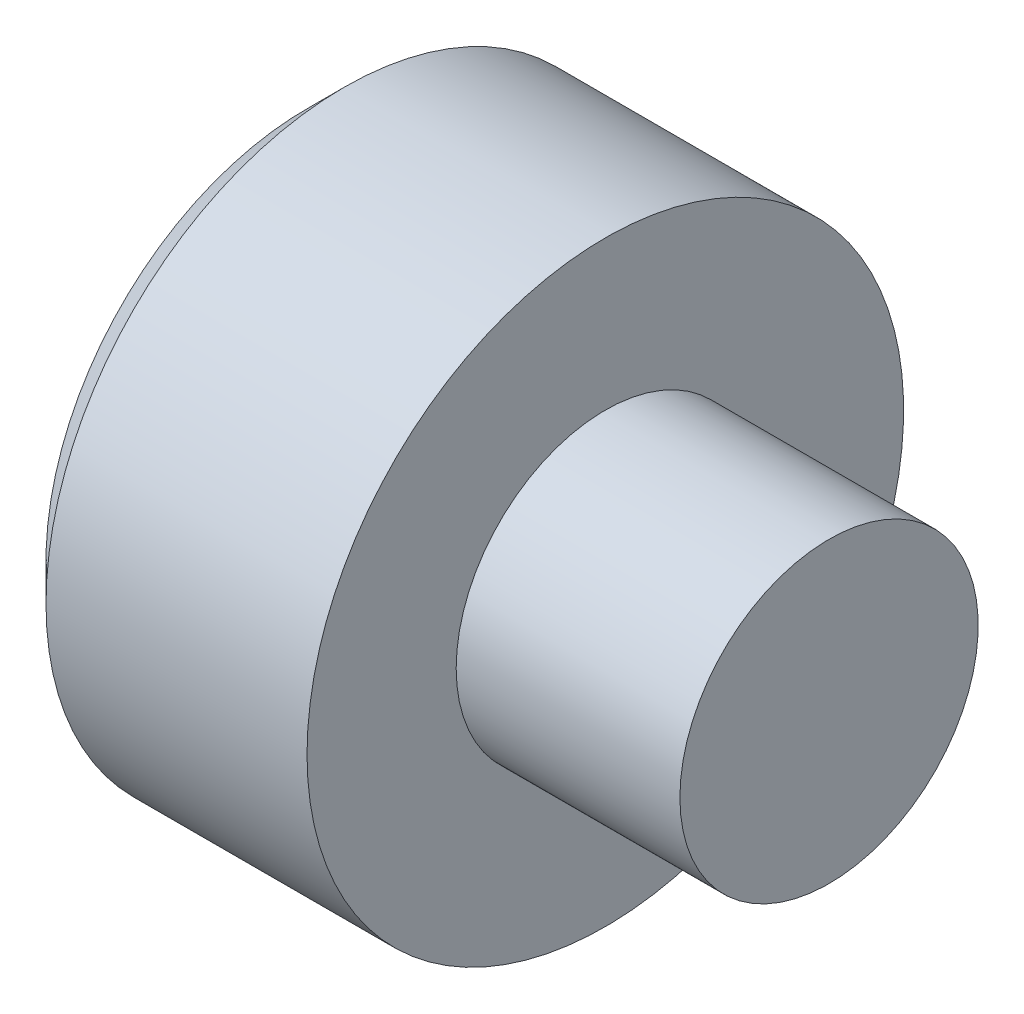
ISO-10303-21;
HEADER;
FILE_DESCRIPTION(('STEP AP214'),'2;1');
FILE_NAME('part.step','',(''),(''),'','','');
FILE_SCHEMA(('AUTOMOTIVE_DESIGN { 1 0 10303 214 1 1 1 1 }'));
ENDSEC;
DATA;
#1=APPLICATION_CONTEXT('core data for automotive mechanical design processes');
#2=APPLICATION_PROTOCOL_DEFINITION('international standard','automotive_design',2000,#1);
#3=PRODUCT_CONTEXT('',#1,'mechanical');
#4=PRODUCT('Part','Part','',(#3));
#5=PRODUCT_RELATED_PRODUCT_CATEGORY('part','',(#4));
#6=PRODUCT_DEFINITION_FORMATION('','',#4);
#7=PRODUCT_DEFINITION_CONTEXT('part definition',#1,'design');
#8=PRODUCT_DEFINITION('design','',#6,#7);
#9=PRODUCT_DEFINITION_SHAPE('','',#8);
#10=(LENGTH_UNIT() NAMED_UNIT(*) SI_UNIT(.MILLI.,.METRE.));
#11=(NAMED_UNIT(*) PLANE_ANGLE_UNIT() SI_UNIT($,.RADIAN.));
#12=(NAMED_UNIT(*) SI_UNIT($,.STERADIAN.) SOLID_ANGLE_UNIT());
#13=UNCERTAINTY_MEASURE_WITH_UNIT(LENGTH_MEASURE(1.E-05),#10,'distance_accuracy_value','');
#14=(GEOMETRIC_REPRESENTATION_CONTEXT(3) GLOBAL_UNCERTAINTY_ASSIGNED_CONTEXT((#13)) GLOBAL_UNIT_ASSIGNED_CONTEXT((#10,
#11,#12)) REPRESENTATION_CONTEXT('',''));
#15=CARTESIAN_POINT('',(0.,0.,0.));
#16=DIRECTION('',(0.,0.,1.));
#17=DIRECTION('',(1.,0.,0.));
#18=AXIS2_PLACEMENT_3D('',#15,#16,#17);
#19=CARTESIAN_POINT('',(0.,0.,0.));
#20=DIRECTION('',(1.,0.,0.));
#21=DIRECTION('',(0.,0.,-1.));
#22=AXIS2_PLACEMENT_3D('',#19,#20,#21);
#23=PLANE('',#22);
#24=CARTESIAN_POINT('',(0.,0.,0.));
#25=DIRECTION('',(1.,0.,0.));
#26=DIRECTION('',(0.,0.,-1.));
#27=AXIS2_PLACEMENT_3D('',#24,#25,#26);
#28=CIRCLE('',#27,3.5);
#29=CARTESIAN_POINT('',(0.,0.,-3.5));
#30=VERTEX_POINT('',#29);
#31=EDGE_CURVE('E37',#30,#30,#28,.F.);
#32=ORIENTED_EDGE('',*,*,#31,.T.);
#33=EDGE_LOOP('',(#32));
#34=FACE_BOUND('',#33,.T.);
#35=ADVANCED_FACE('F31',(#34),#23,.F.);
#36=CARTESIAN_POINT('',(-17.1561403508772,0.,0.));
#37=DIRECTION('',(-1.,0.,0.));
#38=DIRECTION('',(0.,0.,1.));
#39=AXIS2_PLACEMENT_3D('',#36,#37,#38);
#40=CYLINDRICAL_SURFACE('',#39,4.);
#41=CARTESIAN_POINT('',(0.5,0.,0.));
#42=DIRECTION('',(1.,0.,0.));
#43=DIRECTION('',(0.,0.,-1.));
#44=AXIS2_PLACEMENT_3D('',#41,#42,#43);
#45=CIRCLE('',#44,4.);
#46=CARTESIAN_POINT('',(0.5,0.,-4.));
#47=VERTEX_POINT('',#46);
#48=EDGE_CURVE('E10',#47,#47,#45,.T.);
#49=ORIENTED_EDGE('',*,*,#48,.T.);
#50=EDGE_LOOP('',(#49));
#51=FACE_BOUND('',#50,.T.);
#52=CARTESIAN_POINT('',(4.,0.,0.));
#53=DIRECTION('',(-1.,0.,0.));
#54=DIRECTION('',(0.,0.,1.));
#55=AXIS2_PLACEMENT_3D('',#52,#53,#54);
#56=CIRCLE('',#55,4.);
#57=CARTESIAN_POINT('',(4.,0.,4.));
#58=VERTEX_POINT('',#57);
#59=EDGE_CURVE('E41',#58,#58,#56,.T.);
#60=ORIENTED_EDGE('',*,*,#59,.T.);
#61=EDGE_LOOP('',(#60));
#62=FACE_BOUND('',#61,.T.);
#63=ADVANCED_FACE('F70',(#51,#62),#40,.T.);
#64=CARTESIAN_POINT('',(4.,4.,0.));
#65=DIRECTION('',(-1.,0.,0.));
#66=DIRECTION('',(0.,0.,1.));
#67=AXIS2_PLACEMENT_3D('',#64,#65,#66);
#68=PLANE('',#67);
#69=ORIENTED_EDGE('',*,*,#59,.F.);
#70=EDGE_LOOP('',(#69));
#71=FACE_BOUND('',#70,.T.);
#72=CARTESIAN_POINT('',(4.,0.,0.));
#73=DIRECTION('',(-1.,0.,0.));
#74=DIRECTION('',(0.,0.,1.));
#75=AXIS2_PLACEMENT_3D('',#72,#73,#74);
#76=CIRCLE('',#75,2.);
#77=CARTESIAN_POINT('',(4.,0.,2.));
#78=VERTEX_POINT('',#77);
#79=EDGE_CURVE('E45',#78,#78,#76,.T.);
#80=ORIENTED_EDGE('',*,*,#79,.T.);
#81=EDGE_LOOP('',(#80));
#82=FACE_BOUND('',#81,.T.);
#83=ADVANCED_FACE('F66',(#71,#82),#68,.F.);
#84=CARTESIAN_POINT('',(-17.1561403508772,0.,0.));
#85=DIRECTION('',(-1.,0.,0.));
#86=DIRECTION('',(0.,0.,1.));
#87=AXIS2_PLACEMENT_3D('',#84,#85,#86);
#88=CYLINDRICAL_SURFACE('',#87,2.);
#89=ORIENTED_EDGE('',*,*,#79,.F.);
#90=EDGE_LOOP('',(#89));
#91=FACE_BOUND('',#90,.T.);
#92=CARTESIAN_POINT('',(7.,0.,0.));
#93=DIRECTION('',(-1.,0.,0.));
#94=DIRECTION('',(0.,0.,1.));
#95=AXIS2_PLACEMENT_3D('',#92,#93,#94);
#96=CIRCLE('',#95,2.);
#97=CARTESIAN_POINT('',(7.,0.,2.));
#98=VERTEX_POINT('',#97);
#99=EDGE_CURVE('E50',#98,#98,#96,.T.);
#100=ORIENTED_EDGE('',*,*,#99,.T.);
#101=EDGE_LOOP('',(#100));
#102=FACE_BOUND('',#101,.T.);
#103=ADVANCED_FACE('F54',(#91,#102),#88,.T.);
#104=CARTESIAN_POINT('',(7.,2.,0.));
#105=DIRECTION('',(-1.,0.,0.));
#106=DIRECTION('',(0.,0.,1.));
#107=AXIS2_PLACEMENT_3D('',#104,#105,#106);
#108=PLANE('',#107);
#109=ORIENTED_EDGE('',*,*,#99,.F.);
#110=EDGE_LOOP('',(#109));
#111=FACE_BOUND('',#110,.T.);
#112=ADVANCED_FACE('F56',(#111),#108,.F.);
#113=CARTESIAN_POINT('',(0.,0.,0.));
#114=DIRECTION('',(1.,0.,0.));
#115=DIRECTION('',(0.,0.,-1.));
#116=AXIS2_PLACEMENT_3D('',#113,#114,#115);
#117=CONICAL_SURFACE('',#116,3.5,0.785398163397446);
#118=ORIENTED_EDGE('',*,*,#48,.F.);
#119=EDGE_LOOP('',(#118));
#120=FACE_BOUND('',#119,.T.);
#121=ORIENTED_EDGE('',*,*,#31,.F.);
#122=EDGE_LOOP('',(#121));
#123=FACE_BOUND('',#122,.T.);
#124=ADVANCED_FACE('F58',(#120,#123),#117,.T.);
#125=CLOSED_SHELL('',(#35,#63,#83,#103,#112,#124));
#126=MANIFOLD_SOLID_BREP('B2',#125);
#127=ADVANCED_BREP_SHAPE_REPRESENTATION('',(#18,#126),#14);
#128=SHAPE_DEFINITION_REPRESENTATION(#9,#127);
ENDSEC;
END-ISO-10303-21;
